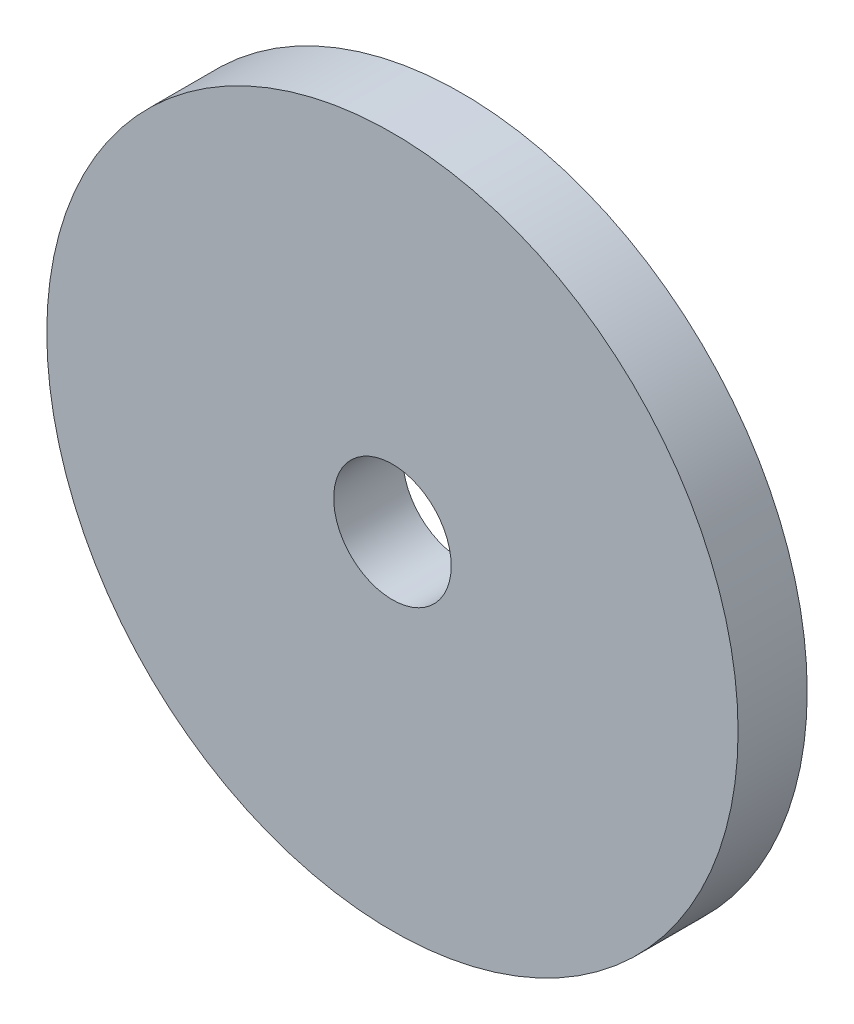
ISO-10303-21;
HEADER;
FILE_DESCRIPTION(('STEP AP214'),'2;1');
FILE_NAME('part.step','',(''),(''),'','','');
FILE_SCHEMA(('AUTOMOTIVE_DESIGN { 1 0 10303 214 1 1 1 1 }'));
ENDSEC;
DATA;
#1=APPLICATION_CONTEXT('core data for automotive mechanical design processes');
#2=APPLICATION_PROTOCOL_DEFINITION('international standard','automotive_design',2000,#1);
#3=PRODUCT_CONTEXT('',#1,'mechanical');
#4=PRODUCT('Part','Part','',(#3));
#5=PRODUCT_RELATED_PRODUCT_CATEGORY('part','',(#4));
#6=PRODUCT_DEFINITION_FORMATION('','',#4);
#7=PRODUCT_DEFINITION_CONTEXT('part definition',#1,'design');
#8=PRODUCT_DEFINITION('design','',#6,#7);
#9=PRODUCT_DEFINITION_SHAPE('','',#8);
#10=(LENGTH_UNIT() NAMED_UNIT(*) SI_UNIT(.MILLI.,.METRE.));
#11=(NAMED_UNIT(*) PLANE_ANGLE_UNIT() SI_UNIT($,.RADIAN.));
#12=(NAMED_UNIT(*) SI_UNIT($,.STERADIAN.) SOLID_ANGLE_UNIT());
#13=UNCERTAINTY_MEASURE_WITH_UNIT(LENGTH_MEASURE(1.E-05),#10,'distance_accuracy_value','');
#14=(GEOMETRIC_REPRESENTATION_CONTEXT(3) GLOBAL_UNCERTAINTY_ASSIGNED_CONTEXT((#13)) GLOBAL_UNIT_ASSIGNED_CONTEXT((#10,
#11,#12)) REPRESENTATION_CONTEXT('',''));
#15=CARTESIAN_POINT('',(0.,0.,0.));
#16=DIRECTION('',(0.,0.,1.));
#17=DIRECTION('',(1.,0.,0.));
#18=AXIS2_PLACEMENT_3D('',#15,#16,#17);
#19=CARTESIAN_POINT('',(0.,0.,5.));
#20=DIRECTION('',(0.,0.,1.));
#21=DIRECTION('',(1.,0.,0.));
#22=AXIS2_PLACEMENT_3D('',#19,#20,#21);
#23=PLANE('',#22);
#24=CARTESIAN_POINT('',(0.,0.,5.));
#25=DIRECTION('',(0.,0.,1.));
#26=DIRECTION('',(1.,0.,0.));
#27=AXIS2_PLACEMENT_3D('',#24,#25,#26);
#28=CIRCLE('',#27,25.);
#29=CARTESIAN_POINT('',(25.,0.,5.));
#30=VERTEX_POINT('',#29);
#31=EDGE_CURVE('E10',#30,#30,#28,.T.);
#32=ORIENTED_EDGE('',*,*,#31,.T.);
#33=EDGE_LOOP('',(#32));
#34=FACE_BOUND('',#33,.T.);
#35=CARTESIAN_POINT('',(0.,0.,5.));
#36=DIRECTION('',(0.,0.,1.));
#37=DIRECTION('',(1.,0.,0.));
#38=AXIS2_PLACEMENT_3D('',#35,#36,#37);
#39=CIRCLE('',#38,4.25);
#40=CARTESIAN_POINT('',(4.25,0.,5.));
#41=VERTEX_POINT('',#40);
#42=EDGE_CURVE('E40',#41,#41,#39,.T.);
#43=ORIENTED_EDGE('',*,*,#42,.F.);
#44=EDGE_LOOP('',(#43));
#45=FACE_BOUND('',#44,.T.);
#46=ADVANCED_FACE('F29',(#34,#45),#23,.T.);
#47=CARTESIAN_POINT('',(0.,0.,0.));
#48=DIRECTION('',(0.,0.,1.));
#49=DIRECTION('',(1.,0.,0.));
#50=AXIS2_PLACEMENT_3D('',#47,#48,#49);
#51=PLANE('',#50);
#52=CARTESIAN_POINT('',(0.,0.,0.));
#53=DIRECTION('',(0.,0.,1.));
#54=DIRECTION('',(1.,0.,0.));
#55=AXIS2_PLACEMENT_3D('',#52,#53,#54);
#56=CIRCLE('',#55,25.);
#57=CARTESIAN_POINT('',(25.,0.,0.));
#58=VERTEX_POINT('',#57);
#59=EDGE_CURVE('E36',#58,#58,#56,.T.);
#60=ORIENTED_EDGE('',*,*,#59,.F.);
#61=EDGE_LOOP('',(#60));
#62=FACE_BOUND('',#61,.T.);
#63=CARTESIAN_POINT('',(0.,0.,0.));
#64=DIRECTION('',(0.,0.,1.));
#65=DIRECTION('',(1.,0.,0.));
#66=AXIS2_PLACEMENT_3D('',#63,#64,#65);
#67=CIRCLE('',#66,4.25);
#68=CARTESIAN_POINT('',(4.25,0.,0.));
#69=VERTEX_POINT('',#68);
#70=EDGE_CURVE('E44',#69,#69,#67,.T.);
#71=ORIENTED_EDGE('',*,*,#70,.T.);
#72=EDGE_LOOP('',(#71));
#73=FACE_BOUND('',#72,.T.);
#74=ADVANCED_FACE('F50',(#62,#73),#51,.F.);
#75=CARTESIAN_POINT('',(0.,0.,5.));
#76=DIRECTION('',(0.,0.,-1.));
#77=DIRECTION('',(-1.,0.,0.));
#78=AXIS2_PLACEMENT_3D('',#75,#76,#77);
#79=CYLINDRICAL_SURFACE('',#78,25.);
#80=ORIENTED_EDGE('',*,*,#31,.F.);
#81=EDGE_LOOP('',(#80));
#82=FACE_BOUND('',#81,.T.);
#83=ORIENTED_EDGE('',*,*,#59,.T.);
#84=EDGE_LOOP('',(#83));
#85=FACE_BOUND('',#84,.T.);
#86=ADVANCED_FACE('F31',(#82,#85),#79,.T.);
#87=CARTESIAN_POINT('',(0.,0.,5.));
#88=DIRECTION('',(0.,0.,-1.));
#89=DIRECTION('',(-1.,0.,0.));
#90=AXIS2_PLACEMENT_3D('',#87,#88,#89);
#91=CYLINDRICAL_SURFACE('',#90,4.25);
#92=ORIENTED_EDGE('',*,*,#42,.T.);
#93=EDGE_LOOP('',(#92));
#94=FACE_BOUND('',#93,.T.);
#95=ORIENTED_EDGE('',*,*,#70,.F.);
#96=EDGE_LOOP('',(#95));
#97=FACE_BOUND('',#96,.T.);
#98=ADVANCED_FACE('F52',(#94,#97),#91,.F.);
#99=CLOSED_SHELL('',(#46,#74,#86,#98));
#100=MANIFOLD_SOLID_BREP('B2',#99);
#101=ADVANCED_BREP_SHAPE_REPRESENTATION('',(#18,#100),#14);
#102=SHAPE_DEFINITION_REPRESENTATION(#9,#101);
ENDSEC;
END-ISO-10303-21;
